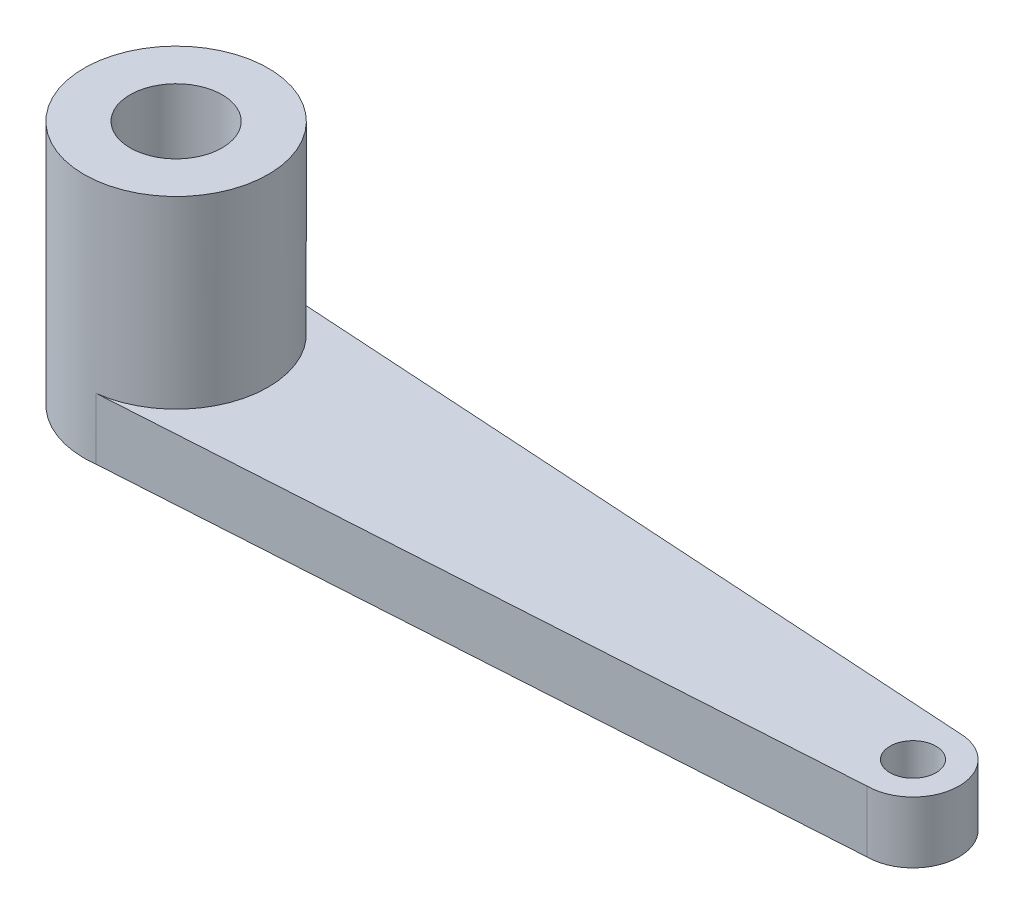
from build123d import *

# Parameters (mm, degrees)
SKETCH1_R           = 3.175
BOSS_EXTRUDE1_DEPTH = 8.466666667
BOSS_EXTRUDE2_DEPTH = 2.116666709
SKETCH3_R           = 1.5875
CUT_EXTRUDE2_DEPTH  = 29.462084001
SKETCH4_R           = 0.79375
CUT_EXTRUDE3_DEPTH  = 29.462084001


with BuildPart() as part:
    # Sketch1 → Boss-Extrude1 (new body)
    with BuildSketch(Plane(origin=(0, 0, 0), x_dir=(1, 0, 0), z_dir=(0, 1, 0))):
        with Locations(Location((0, 0, 0), (0, 0, 270))):
            Circle(SKETCH1_R)
    extrude(amount=BOSS_EXTRUDE1_DEPTH)

    # Sketch2 → Boss-Extrude2 (add)
    with BuildSketch(Plane(origin=(0, 0, 0), x_dir=(-1, 0, 0), z_dir=(0, -1, 0))):
        with BuildLine():
            Line((0, 3.175), (-25.4, 1.5875))
            ThreePointArc((-25.4, 1.5875), (-26.9875, 0), (-25.4, -1.5875))
            Line((-25.4, -1.5875), (0, -3.175))
            Line((0, -3.175), (0, 3.175))
        make_face()
    extrude(amount=-BOSS_EXTRUDE2_DEPTH)

    # Sketch3 → Cut-Extrude2 (cut, through all)
    with BuildSketch(Plane(origin=(0, 8.466666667, 0), x_dir=(1, 0, 0), z_dir=(0, 1, 0))):
        with Locations(Location((0, 0, 0), (0, 0, 270))):
            Circle(SKETCH3_R)
    extrude(amount=-CUT_EXTRUDE2_DEPTH, mode=Mode.SUBTRACT)

    # Sketch4 → Cut-Extrude3 (cut, through all)
    with BuildSketch(Plane(origin=(0, 0, 0), x_dir=(-1, 0, 0), z_dir=(0, -1, 0))):
        with Locations(Location((-25.4, 0, 0), (0, 0, 90))):
            Circle(SKETCH4_R)
    extrude(amount=-CUT_EXTRUDE3_DEPTH, mode=Mode.SUBTRACT)


solid = part.part
